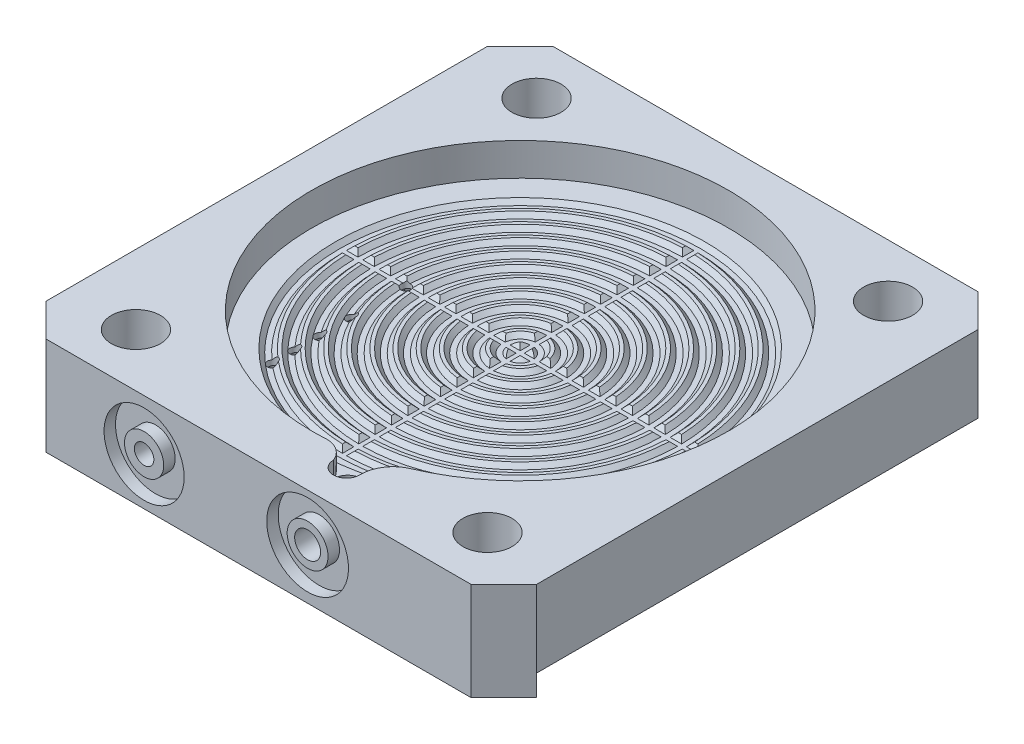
from build123d import *

# Parameters (mm, degrees)
SKETCH1_W                           = 30
SKETCH1_H                           = 31
BOSS_EXTRUDE1_DEPTH                 = 6
SKETCH2_R                           = 12.75
CUT_EXTRUDE1_DEPTH                  = 2
CHAMFER1_SIZE                       = 2
F_3_64_0_04688_DIAMETER_HOLE1_D     = 1.190752
F_3_64_0_04688_DIAMETER_HOLE1_DEPTH = 16.5
F_3_64_0_04688_DIAMETER_HOLE1_TIP   = 0.357737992
F_1_16_0_0625_DIAMETER_HOLE3_D      = 1.5875
F_1_16_0_0625_DIAMETER_HOLE3_DEPTH  = 2.9
F_1_16_0_0625_DIAMETER_HOLE3_TIP    = 0.476933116
SKETCH9_R                           = 2.45
SKETCH9_R_2                         = 1.2
CUT_EXTRUDE2_DEPTH                  = 0.7
SKETCH11_R                          = 2.5
SKETCH11_R_2                        = 1.25
CUT_EXTRUDE4_DEPTH                  = 0.7
CUT_EXTRUDE3_START                  = -10.75
CUT_EXTRUDE3_DEPTH                  = 21.5
M3X0_5_TAPPED_HOLE1_D               = 3
LPATTERN1_COUNT                     = 2
LPATTERN1_PITCH                     = 21.5
LPATTERN1_COUNT_DIR2                = 2
LPATTERN1_PITCH_DIR2                = 24.5
CUT_EXTRUDE7_DEPTH                  = 1
CUT_EXTRUDE8_DEPTH                  = 2.2
CUT_EXTRUDE9_DEPTH                  = 1
F_73_0_024_DIAMETER_HOLE1_REACH     = 24.293
F_73_0_024_DIAMETER_HOLE1_BORE_R    = 0.3048
CUT_EXTRUDE10_START                 = -10.75
CUT_EXTRUDE10_DEPTH                 = 21.5
SKETCH70_W                          = 30
SKETCH70_H                          = 29
CUT_EXTRUDE12_DEPTH                 = 1.3


with BuildPart() as part:
    # Sketch1 → Boss-Extrude1 (new body)
    with BuildSketch(Plane(origin=(0, 0, 0), x_dir=(1, 0, 0), z_dir=(0, 1, 0))):
        with Locations((0, -0.5)):
            Rectangle(SKETCH1_W, SKETCH1_H)
    extrude(amount=BOSS_EXTRUDE1_DEPTH)

    # Sketch2 → Cut-Extrude1 (cut)
    with BuildSketch(Plane(origin=(0, 6, 0), x_dir=(1, 0, 0), z_dir=(0, 1, 0))):
        with Locations(Location((0, 0, 0), (0, 0, 270))):
            Circle(SKETCH2_R)
    extrude(amount=-CUT_EXTRUDE1_DEPTH, mode=Mode.SUBTRACT)

    # Sketch3 → Cut-Revolve1 (revolve, cut)
    with BuildSketch(Plane.XY, mode=Mode.PRIVATE) as cut_revolve1_sk:
        Polygon((1.05, 3.75), (1.3, 4), (0.5, 4), (0.75, 3.75), align=None)
        Polygon((2.3, 4), (1.5, 4), (1.75, 3.75), (2.05, 3.75), align=None)
        Polygon((3.3, 4), (2.5, 4), (2.75, 3.75), (3.05, 3.75), align=None)
        Polygon((4.3, 4), (3.5, 4), (3.75, 3.75), (4.05, 3.75), align=None)
        Polygon((5.3, 4), (4.5, 4), (4.75, 3.75), (5.05, 3.75), align=None)
        Polygon((6.3, 4), (5.5, 4), (5.75, 3.75), (6.05, 3.75), align=None)
        Polygon((7.3, 4), (6.5, 4), (6.75, 3.75), (7.05, 3.75), align=None)
        Polygon((8.3, 4), (7.5, 4), (7.75, 3.75), (8.05, 3.75), align=None)
        Polygon((9.3, 4), (8.5, 4), (8.75, 3.75), (9.05, 3.75), align=None)
        Polygon((10.3, 4), (9.5, 4), (9.75, 3.75), (10.05, 3.75), align=None)
        Polygon((11.3, 4), (10.5, 4), (10.75, 3.75), (11.05, 3.75), align=None)
    revolve(cut_revolve1_sk.sketch.rotate(Axis((0, 6.558279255, 0), (0, -1, 0)), 180), axis=Axis((0, 6.558279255, 0), (0, -1, 0)), mode=Mode.SUBTRACT)

    # Chamfer1
    chamfer1_edges = [part.edges().sort_by_distance(p)[0] for p in [
        (-15, 3, -15),
        (15, 3, -15),
        (15, 3, 16),
        (-15, 3, 16),
    ]]
    chamfer(chamfer1_edges, length=CHAMFER1_SIZE)

    # 3_64 _0.04688_ Diameter Hole1
    with Locations(Plane.XY.offset(16)):
        with Locations((-7, 2.9)):
            Hole(F_3_64_0_04688_DIAMETER_HOLE1_D / 2, depth=F_3_64_0_04688_DIAMETER_HOLE1_DEPTH)
            with Locations((0, 0, -(F_3_64_0_04688_DIAMETER_HOLE1_DEPTH + F_3_64_0_04688_DIAMETER_HOLE1_TIP / 2))):  # 118° drill point
                Cone(0, F_3_64_0_04688_DIAMETER_HOLE1_D / 2, F_3_64_0_04688_DIAMETER_HOLE1_TIP, mode=Mode.SUBTRACT)

    # 1_16 _0.0625_ Diameter Hole3
    with Locations(Plane.XY.offset(16)):
        with Locations((3, 3.1)):
            Hole(F_1_16_0_0625_DIAMETER_HOLE3_D / 2, depth=F_1_16_0_0625_DIAMETER_HOLE3_DEPTH)
            with Locations((0, 0, -(F_1_16_0_0625_DIAMETER_HOLE3_DEPTH + F_1_16_0_0625_DIAMETER_HOLE3_TIP / 2))):  # 118° drill point
                Cone(0, F_1_16_0_0625_DIAMETER_HOLE3_D / 2, F_1_16_0_0625_DIAMETER_HOLE3_TIP, mode=Mode.SUBTRACT)

    # Sketch9 → Cut-Extrude2 (cut)
    with BuildSketch(Plane.XY.offset(16)):
        with Locations((-7, 2.9)):
            Circle(SKETCH9_R)
        with Locations((-7, 2.9)):
            Circle(SKETCH9_R_2, mode=Mode.SUBTRACT)
    extrude(amount=-CUT_EXTRUDE2_DEPTH, mode=Mode.SUBTRACT)

    # Sketch11 → Cut-Extrude4 (cut)
    with BuildSketch(Plane(origin=(0, 14, 16), x_dir=(1, 0, 0), z_dir=(0, 0, 1))):
        with Locations((3, -10.9)):
            Circle(SKETCH11_R)
        with Locations((3, -10.9)):
            Circle(SKETCH11_R_2, mode=Mode.SUBTRACT)
    extrude(amount=-CUT_EXTRUDE4_DEPTH, mode=Mode.SUBTRACT)

    # Sketch10 → Cut-Extrude3 (cut)
    with BuildSketch(Plane(origin=(0, 4, 0), x_dir=(1, 0, 0), z_dir=(0, 0, -1)).offset(CUT_EXTRUDE3_START)):
        Polygon((0.125, 0.25), (0.375, 0), (-0.375, 0), (-0.125, 0.25), align=None)
    extrude(amount=CUT_EXTRUDE3_DEPTH, mode=Mode.SUBTRACT)

    # M3x0.5 Tapped Hole1 (through all)
    with Locations(Plane(origin=(0, 6, 0), x_dir=(-1, 0, 0), z_dir=(0, 1, 0))):
        with Locations((10.75, 12.75)):
            m3x0_5_tapped_hole1 = Hole(M3X0_5_TAPPED_HOLE1_D / 2)

    # LPattern1: M3x0.5 Tapped Hole1 2 × 2
    with Locations(*[(i * LPATTERN1_PITCH, 0, -j * LPATTERN1_PITCH_DIR2) for i in range(LPATTERN1_COUNT) for j in range(LPATTERN1_COUNT_DIR2) if (i, j) != (0, 0)]):
        add(m3x0_5_tapped_hole1, mode=Mode.SUBTRACT)

    # Sketch31 → Cut-Extrude7 (cut)
    with BuildSketch(Plane(origin=(0, 6, 0), x_dir=(1, 0, 0), z_dir=(0, 1, 0))):
        with BuildLine():
            Line((2.20625, -13.625), (2.20625, -10.875))
            ThreePointArc((2.20625, -10.875), (3, -10.08125), (3.79375, -10.875))
            Line((3.79375, -10.875), (3.79375, -13.625))
            ThreePointArc((3.79375, -13.625), (3, -14.41875), (2.20625, -13.625))
        make_face()
    extrude(amount=-CUT_EXTRUDE7_DEPTH, mode=Mode.SUBTRACT)

    # Sketch32 → Cut-Extrude8 (cut)
    with BuildSketch(Plane(origin=(0, 5, 0), x_dir=(1, 0, 0), z_dir=(0, 1, 0))):
        with BuildLine():
            Line((2.20625, -13.625), (2.20625, -13.5488))
            ThreePointArc((2.20625, -13.5488), (3, -12.75505), (3.79375, -13.5488))
            Line((3.79375, -13.5488), (3.79375, -13.625))
            ThreePointArc((3.79375, -13.625), (3, -14.41875), (2.20625, -13.625))
        make_face()
    extrude(amount=-CUT_EXTRUDE8_DEPTH, mode=Mode.SUBTRACT)

    # Sketch36 → Cut-Extrude9 (cut)
    with BuildSketch(Plane(origin=(0, 6, 0), x_dir=(1, 0, 0), z_dir=(0, 1, 0))):
        with BuildLine():
            ThreePointArc((3.79375, -13.505914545), (4.140610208, -12.438206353), (5.007871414, -11.725345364))
            ThreePointArc((5.007871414, -11.725345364), (4.406486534, -11.964337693), (3.79375, -12.172508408))
            Line((3.79375, -12.172508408), (3.79375, -13.505914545))
        make_face()
        with BuildLine():
            ThreePointArc((0.808480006, -12.724341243), (1.655562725, -12.944676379), (2.20625, -13.625))
            Line((2.20625, -13.625), (2.20625, -12.557665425))
            ThreePointArc((2.20625, -12.557665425), (1.509667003, -12.660308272), (0.808480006, -12.724341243))
        make_face()
    extrude(amount=-CUT_EXTRUDE9_DEPTH, mode=Mode.SUBTRACT)

    # 73 _0.024_ Diameter Hole1 bore → 73 _0.024_ Diameter Hole1 (cut, up to next)
    with BuildSketch(Plane(origin=(0, 4, 0), x_dir=(-1, 0, 0), z_dir=(0, 1, 0)), mode=Mode.PRIVATE) as f_73_0_024_diameter_hole1_sk1:
        with Locations((7, 0)):
            Circle(F_73_0_024_DIAMETER_HOLE1_BORE_R)
    f_73_0_024_diameter_hole1_tool1 = extrude(f_73_0_024_diameter_hole1_sk1.sketch, amount=-F_73_0_024_DIAMETER_HOLE1_REACH, mode=Mode.PRIVATE) & part.part
    # 73 _0.024_ Diameter Hole1 bore → 73 _0.024_ Diameter Hole1 (cut, up to next)
    with BuildSketch(Plane(origin=(0, 4, 0), x_dir=(-1, 0, 0), z_dir=(0, 1, 0)), mode=Mode.PRIVATE) as f_73_0_024_diameter_hole1_sk2:
        with Locations((7, 3.326033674)):
            Circle(F_73_0_024_DIAMETER_HOLE1_BORE_R)
    f_73_0_024_diameter_hole1_tool2 = extrude(f_73_0_024_diameter_hole1_sk2.sketch, amount=-F_73_0_024_DIAMETER_HOLE1_REACH, mode=Mode.PRIVATE) & part.part
    # 73 _0.024_ Diameter Hole1 bore → 73 _0.024_ Diameter Hole1 (cut, up to next)
    with BuildSketch(Plane(origin=(0, 4, 0), x_dir=(-1, 0, 0), z_dir=(0, 1, 0)), mode=Mode.PRIVATE) as f_73_0_024_diameter_hole1_sk3:
        with Locations((7, 5.25)):
            Circle(F_73_0_024_DIAMETER_HOLE1_BORE_R)
    f_73_0_024_diameter_hole1_tool3 = extrude(f_73_0_024_diameter_hole1_sk3.sketch, amount=-F_73_0_024_DIAMETER_HOLE1_REACH, mode=Mode.PRIVATE) & part.part
    # 73 _0.024_ Diameter Hole1 bore → 73 _0.024_ Diameter Hole1 (cut, up to next)
    with BuildSketch(Plane(origin=(0, 4, 0), x_dir=(-1, 0, 0), z_dir=(0, 1, 0)), mode=Mode.PRIVATE) as f_73_0_024_diameter_hole1_sk4:
        with Locations((7, 6.78693598)):
            Circle(F_73_0_024_DIAMETER_HOLE1_BORE_R)
    f_73_0_024_diameter_hole1_tool4 = extrude(f_73_0_024_diameter_hole1_sk4.sketch, amount=-F_73_0_024_DIAMETER_HOLE1_REACH, mode=Mode.PRIVATE) & part.part
    # 73 _0.024_ Diameter Hole1 bore → 73 _0.024_ Diameter Hole1 (cut, up to next)
    with BuildSketch(Plane(origin=(0, 4, 0), x_dir=(-1, 0, 0), z_dir=(0, 1, 0)), mode=Mode.PRIVATE) as f_73_0_024_diameter_hole1_sk5:
        with Locations((7, 8.158584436)):
            Circle(F_73_0_024_DIAMETER_HOLE1_BORE_R)
    f_73_0_024_diameter_hole1_tool5 = extrude(f_73_0_024_diameter_hole1_sk5.sketch, amount=-F_73_0_024_DIAMETER_HOLE1_REACH, mode=Mode.PRIVATE) & part.part
    add(f_73_0_024_diameter_hole1_tool1.solids().sort_by_distance((-7, 4, 0))[0], mode=Mode.SUBTRACT)
    add(f_73_0_024_diameter_hole1_tool2.solids().sort_by_distance((-7, 4, 3.326034))[0], mode=Mode.SUBTRACT)
    add(f_73_0_024_diameter_hole1_tool3.solids().sort_by_distance((-7, 4, 5.25))[0], mode=Mode.SUBTRACT)
    add(f_73_0_024_diameter_hole1_tool4.solids().sort_by_distance((-7, 4, 6.786936))[0], mode=Mode.SUBTRACT)
    add(f_73_0_024_diameter_hole1_tool5.solids().sort_by_distance((-7, 4, 8.158584))[0], mode=Mode.SUBTRACT)

    # Sketch64 → Cut-Extrude10 (cut)
    with BuildSketch(Plane(origin=(0, -18, 0), x_dir=(0, 0, -1), z_dir=(1, 0, 0)).offset(CUT_EXTRUDE10_START)):
        Polygon((-0.125, 21.75), (-0.375, 22), (0.375, 22), (0.125, 21.75), align=None)
    extrude(amount=CUT_EXTRUDE10_DEPTH, mode=Mode.SUBTRACT)

    # Sketch70 → Cut-Extrude12 (cut)
    with BuildSketch(Plane.XZ):
        with Locations((0, -0.5)):
            Rectangle(SKETCH70_W, SKETCH70_H)
    extrude(amount=-CUT_EXTRUDE12_DEPTH, mode=Mode.SUBTRACT)


solid = part.part
